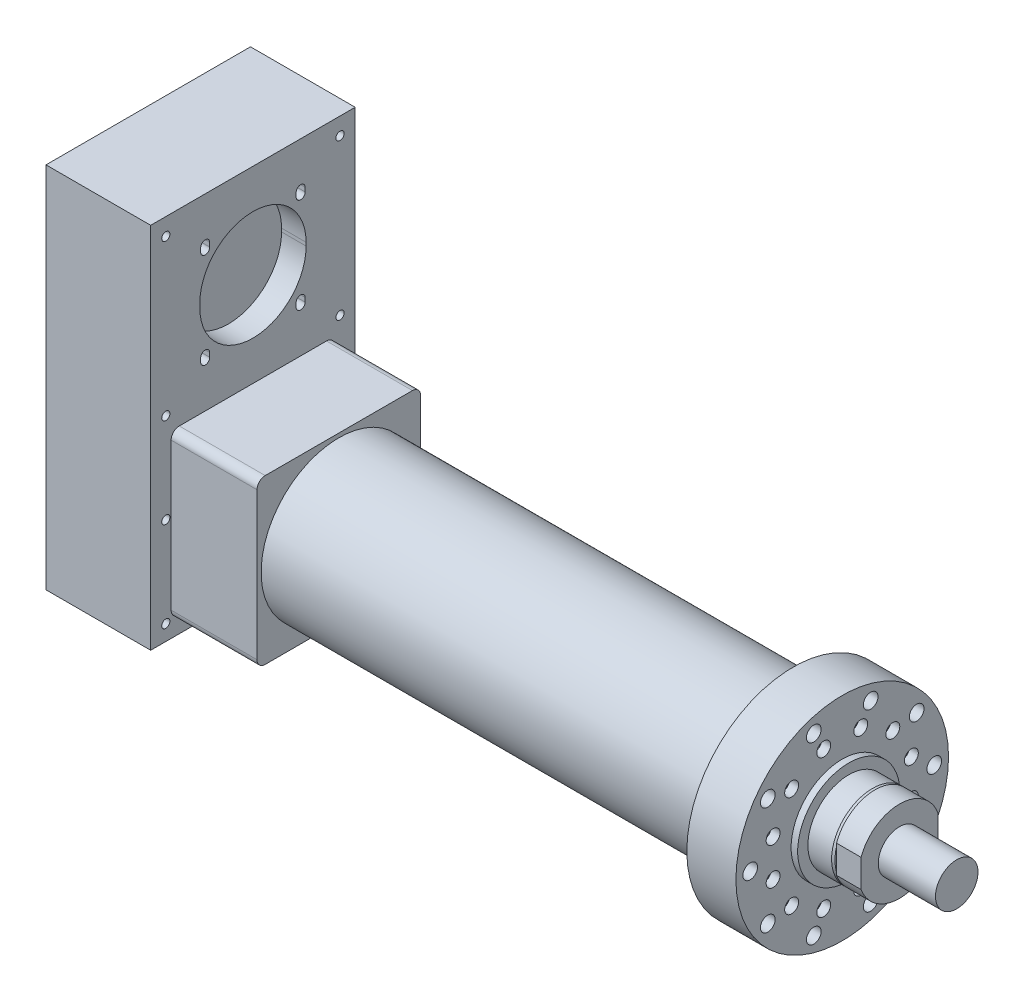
from build123d import *

# Parameters (mm, degrees)
SKETCH_1_R           = 95
SKETCH_1_R_2         = 80
EXTRUDE_1_DEPTH      = 555.5
SKETCH_2_R           = 130
EXTRUDE_2_DEPTH      = 60
SKETCH_3_R           = 62.5
EXTRUDE_3_DEPTH      = 8
SKETCH_4_R           = 5.5
SKETCH_4_R_2         = 9
CUT_EXTRUDE_1_DEPTH  = 60
SKETCH_5_R           = 13
CUT_EXTRUDE_2_DEPTH  = 17
SKETCH_4_3_R         = 8.5
CUT_EXTRUDE_3_DEPTH  = 11
SKETCH_6_R           = 50
EXTRUDE_4_DEPTH      = 32
CHAMFER_1_SIZE       = 3
CHAMFER_1_SIZE2      = 1.091910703
EXTRUDE_5_DEPTH      = 30
SKETCH_8_R           = 26
CUT_EXTRUDE_4_DEPTH  = 82
EXTRUDE_6_DEPTH      = 105
SKETCH_14_W          = 250
SKETCH_14_H          = 450
EXTRUDE_8_DEPTH      = 128
SKETCH_15_R          = 5
CUT_EXTRUDE_10_DEPTH = 128
CUT_EXTRUDE_11_DEPTH = 30
SKETCH_16_R          = 26
EXTRUDE_9_DEPTH      = 70


with BuildPart() as part:
    # Sketch 1 → Extrude 1 (new body)
    with BuildSketch(Plane(origin=(0, 0, 0), x_dir=(0, 0, -1), z_dir=(1, 0, 0))):
        Circle(SKETCH_1_R)
        Circle(SKETCH_1_R_2, mode=Mode.SUBTRACT)
    extrude(amount=EXTRUDE_1_DEPTH)

    # Sketch 2 → Extrude 2 (add)
    with BuildSketch(Plane(origin=(555.5, 0, 0), x_dir=(0, 0, -1), z_dir=(1, 0, 0))):
        Circle(SKETCH_2_R)
    extrude(amount=EXTRUDE_2_DEPTH)

    # Sketch 3 → Extrude 3 (add)
    with BuildSketch(Plane(origin=(615.5, 0, 0), x_dir=(0, 0, -1), z_dir=(1, 0, 0))):
        Circle(SKETCH_3_R)
    extrude(amount=EXTRUDE_3_DEPTH)

    # Sketch 4 → Cut-Extrude 1 (cut)
    with BuildSketch(Plane(origin=(615.5, 0, 0), x_dir=(0, 0, -1), z_dir=(1, 0, 0))):
        with Locations((61.871843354, 61.871843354)):
            Circle(SKETCH_4_R)
        with Locations((91.014411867, 66.125840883)):
            Circle(SKETCH_4_R_2)
        with Locations((84.5185098, 22.646666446)):
            Circle(SKETCH_4_R)
        with Locations((34.764411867, 106.993858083)):
            Circle(SKETCH_4_R_2)
        with Locations((22.646666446, 84.5185098)):
            Circle(SKETCH_4_R)
        with Locations((112.5, 0)):
            Circle(SKETCH_4_R_2)
        with Locations((84.5185098, -22.646666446)):
            Circle(SKETCH_4_R)
        with Locations((91.014411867, -66.125840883)):
            Circle(SKETCH_4_R_2)
        with Locations((61.871843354, -61.871843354)):
            Circle(SKETCH_4_R)
        with Locations((22.646666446, -84.5185098)):
            Circle(SKETCH_4_R)
        with Locations((34.764411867, -106.993858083)):
            Circle(SKETCH_4_R_2)
        with Locations((-34.764411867, -106.993858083)):
            Circle(SKETCH_4_R_2)
        with Locations((-22.646666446, -84.5185098)):
            Circle(SKETCH_4_R)
        with Locations((-61.871843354, -61.871843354)):
            Circle(SKETCH_4_R)
        with Locations((-91.014411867, -66.125840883)):
            Circle(SKETCH_4_R_2)
        with Locations((-112.5, 0)):
            Circle(SKETCH_4_R_2)
        with Locations((-84.5185098, -22.646666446)):
            Circle(SKETCH_4_R)
        with Locations((-84.5185098, 22.646666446)):
            Circle(SKETCH_4_R)
        with Locations((-61.871843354, 61.871843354)):
            Circle(SKETCH_4_R)
        with Locations((-91.014411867, 66.125840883)):
            Circle(SKETCH_4_R_2)
        with Locations((-22.646666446, 84.5185098)):
            Circle(SKETCH_4_R)
        with Locations((-34.764411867, 106.993858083)):
            Circle(SKETCH_4_R_2)
    extrude(amount=-CUT_EXTRUDE_1_DEPTH, mode=Mode.SUBTRACT)

    # Sketch 5 → Cut-Extrude 2 (cut)
    with BuildSketch(Plane.ZY.offset(-555.5)):
        with Locations((-34.764411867, 106.993858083)):
            Circle(SKETCH_5_R)
        with Locations((34.764411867, 106.993858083)):
            Circle(SKETCH_5_R)
        with Locations((91.014411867, 66.125840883)):
            Circle(SKETCH_5_R)
        with Locations((112.5, 0)):
            Circle(SKETCH_5_R)
        with Locations((91.014411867, -66.125840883)):
            Circle(SKETCH_5_R)
        with Locations((34.764411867, -106.993858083)):
            Circle(SKETCH_5_R)
        with Locations((-34.764411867, -106.993858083)):
            Circle(SKETCH_5_R)
        with Locations((-91.014411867, -66.125840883)):
            Circle(SKETCH_5_R)
        with Locations((-112.5, 0)):
            Circle(SKETCH_5_R)
        with Locations((-91.014411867, 66.125840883)):
            Circle(SKETCH_5_R)
    extrude(amount=-CUT_EXTRUDE_2_DEPTH, mode=Mode.SUBTRACT)

    # Sketch 4_3 → Cut-Extrude 3 (cut)
    with BuildSketch(Plane(origin=(615.5, 0, 0), x_dir=(0, 0, -1), z_dir=(1, 0, 0))):
        with Locations((-22.646666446, 84.5185098)):
            Circle(SKETCH_4_3_R)
        with Locations((22.646666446, 84.5185098)):
            Circle(SKETCH_4_3_R)
        with Locations((61.871843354, 61.871843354)):
            Circle(SKETCH_4_3_R)
        with Locations((84.5185098, 22.646666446)):
            Circle(SKETCH_4_3_R)
        with Locations((84.5185098, -22.646666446)):
            Circle(SKETCH_4_3_R)
        with Locations((61.871843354, -61.871843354)):
            Circle(SKETCH_4_3_R)
        with Locations((22.646666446, -84.5185098)):
            Circle(SKETCH_4_3_R)
        with Locations((-22.646666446, -84.5185098)):
            Circle(SKETCH_4_3_R)
        with Locations((-61.871843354, -61.871843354)):
            Circle(SKETCH_4_3_R)
        with Locations((-84.5185098, -22.646666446)):
            Circle(SKETCH_4_3_R)
        with Locations((-84.5185098, 22.646666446)):
            Circle(SKETCH_4_3_R)
        with Locations((-61.871843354, 61.871843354)):
            Circle(SKETCH_4_3_R)
    extrude(amount=-CUT_EXTRUDE_3_DEPTH, mode=Mode.SUBTRACT)

    # Sketch 6 → Extrude 4 (add)
    with BuildSketch(Plane(origin=(623.5, 0, 0), x_dir=(0, 0, -1), z_dir=(1, 0, 0))):
        Circle(SKETCH_6_R)
    extrude(amount=EXTRUDE_4_DEPTH)

    # Chamfer 1
    chamfer_1_edges = [part.edges().sort_by_distance(p)[0] for p in [
        (655.5, 0, 50),
    ]]
    chamfer_1_side = [part.faces().sort_by_distance(p)[0] for p in [
        (639.5, 0, 50),
    ]]
    chamfer(chamfer_1_edges, length=CHAMFER_1_SIZE, length2=CHAMFER_1_SIZE2, reference=chamfer_1_side[0])

    # Sketch 7 → Extrude 5 (add)
    with BuildSketch(Plane(origin=(655.5, 0, 0), x_dir=(0, 0, -1), z_dir=(1, 0, 0))):
        with BuildLine():
            Line((-47, 17.058722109), (-47, -17.058722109))
            ThreePointArc((-47, -17.058722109), (0, -50), (47, -17.058722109))
            Line((47, -17.058722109), (47, 17.058722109))
            ThreePointArc((47, 17.058722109), (0, 50), (-47, 17.058722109))
        make_face()
    extrude(amount=EXTRUDE_5_DEPTH)

    # Sketch 8 → Cut-Extrude 4 (cut)
    with BuildSketch(Plane(origin=(685.5, 0, 0), x_dir=(0, 0, -1), z_dir=(1, 0, 0))):
        Circle(SKETCH_8_R)
    extrude(amount=-CUT_EXTRUDE_4_DEPTH, mode=Mode.SUBTRACT)

    # Sketch 9 → Extrude 6 (add)
    with BuildSketch(Plane.ZY):
        with BuildLine():
            Line((-90, 100), (90, 100))
            ThreePointArc((90, 100), (97.071067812, 97.071067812), (100, 90))
            Line((100, 90), (100, -90))
            ThreePointArc((100, -90), (97.071067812, -97.071067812), (90, -100))
            Line((90, -100), (-90, -100))
            ThreePointArc((-90, -100), (-97.071067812, -97.071067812), (-100, -90))
            Line((-100, -90), (-100, 90))
            ThreePointArc((-100, 90), (-97.071067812, 97.071067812), (-90, 100))
        make_face()
    extrude(amount=EXTRUDE_6_DEPTH)

    # Sketch 14 → Extrude 8 (add)
    with BuildSketch(Plane.ZY.offset(105)):
        with Locations((0, 105)):
            Rectangle(SKETCH_14_W, SKETCH_14_H)
    extrude(amount=EXTRUDE_8_DEPTH)

    # Sketch 15 → Cut-Extrude 10 (cut)
    with BuildSketch(Plane(origin=(-105, 0, 0), x_dir=(0, 0, -1), z_dir=(1, 0, 0))):
        with Locations((-106.5, 309)):
            Circle(SKETCH_15_R)
        with Locations((106.5, 309)):
            Circle(SKETCH_15_R)
        with Locations((106.5, 119)):
            Circle(SKETCH_15_R)
        with Locations((-106.5, 119)):
            Circle(SKETCH_15_R)
        with Locations((-106.5, 9)):
            Circle(SKETCH_15_R)
        with Locations((106.5, 9)):
            Circle(SKETCH_15_R)
        with Locations((-106.5, -101)):
            Circle(SKETCH_15_R)
        with Locations((106.5, -101)):
            Circle(SKETCH_15_R)
    extrude(amount=-CUT_EXTRUDE_10_DEPTH, mode=Mode.SUBTRACT)

    # Sketch 15_3 → Cut-Extrude 11 (cut)
    with BuildSketch(Plane(origin=(-105, 0, 0), x_dir=(0, 0, -1), z_dir=(1, 0, 0))):
        with BuildLine():
            Line((-65, 217), (-65, 213))
            ThreePointArc((-65, 213), (0, 148), (65, 213))
            Line((65, 213), (65, 217))
            ThreePointArc((65, 217), (0, 282), (-65, 217))
        make_face()
        with BuildLine():
            Line((-63.836309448, 270.836309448), (-63.836309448, 275.836309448))
            ThreePointArc((-63.836309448, 275.836309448), (-58.336309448, 281.336309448), (-52.836309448, 275.836309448))
            Line((-52.836309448, 275.836309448), (-52.836309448, 270.836309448))
            ThreePointArc((-52.836309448, 270.836309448), (-58.336309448, 265.336309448), (-63.836309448, 270.836309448))
        make_face()
        with BuildLine():
            Line((63.836309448, 270.836309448), (63.836309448, 275.836309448))
            ThreePointArc((63.836309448, 275.836309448), (58.336309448, 281.336309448), (52.836309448, 275.836309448))
            Line((52.836309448, 275.836309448), (52.836309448, 270.836309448))
            ThreePointArc((52.836309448, 270.836309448), (58.336309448, 265.336309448), (63.836309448, 270.836309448))
        make_face()
        with BuildLine():
            Line((63.836309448, 159.163690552), (63.836309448, 154.163690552))
            ThreePointArc((63.836309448, 154.163690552), (58.336309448, 148.663690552), (52.836309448, 154.163690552))
            Line((52.836309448, 154.163690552), (52.836309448, 159.163690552))
            ThreePointArc((52.836309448, 159.163690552), (58.336309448, 164.663690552), (63.836309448, 159.163690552))
        make_face()
        with BuildLine():
            Line((-63.836309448, 159.163690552), (-63.836309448, 154.163690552))
            ThreePointArc((-63.836309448, 154.163690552), (-58.336309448, 148.663690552), (-52.836309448, 154.163690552))
            Line((-52.836309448, 154.163690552), (-52.836309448, 159.163690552))
            ThreePointArc((-52.836309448, 159.163690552), (-58.336309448, 164.663690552), (-63.836309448, 159.163690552))
        make_face()
    extrude(amount=-CUT_EXTRUDE_11_DEPTH, mode=Mode.SUBTRACT)


with BuildPart() as body_2:
    # Sketch 16 → Extrude 9 (new body)
    with BuildSketch(Plane(origin=(685.5, 0, 0), x_dir=(0, 0, -1), z_dir=(1, 0, 0))):
        Circle(SKETCH_16_R)
    extrude(amount=EXTRUDE_9_DEPTH)


solid = Compound([part.part, body_2.part])
